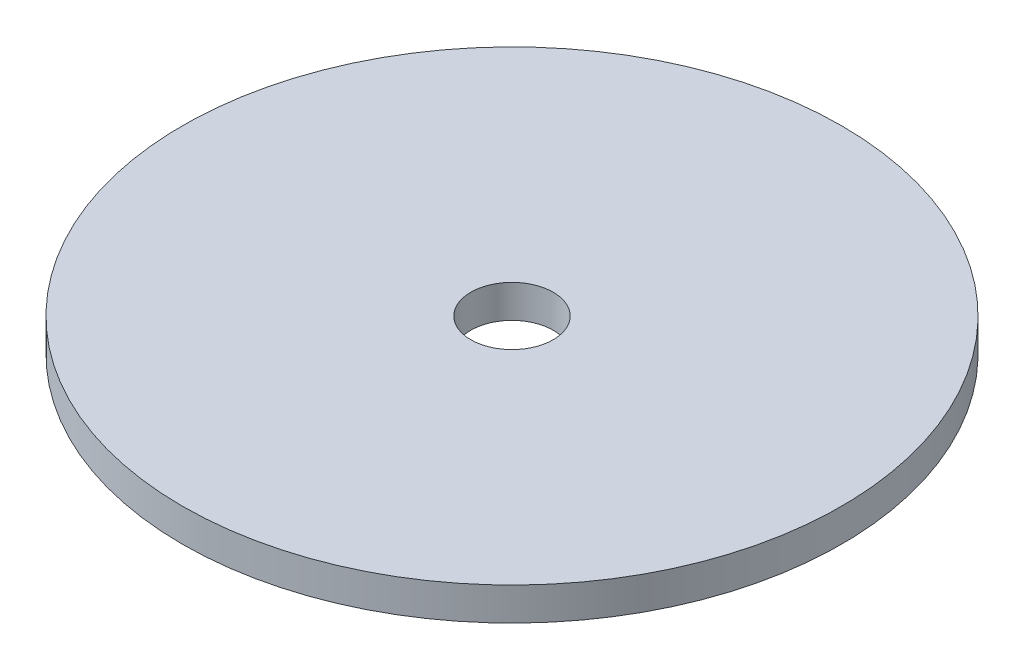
ISO-10303-21;
HEADER;
FILE_DESCRIPTION(('STEP AP214'),'2;1');
FILE_NAME('part.step','',(''),(''),'','','');
FILE_SCHEMA(('AUTOMOTIVE_DESIGN { 1 0 10303 214 1 1 1 1 }'));
ENDSEC;
DATA;
#1=APPLICATION_CONTEXT('core data for automotive mechanical design processes');
#2=APPLICATION_PROTOCOL_DEFINITION('international standard','automotive_design',2000,#1);
#3=PRODUCT_CONTEXT('',#1,'mechanical');
#4=PRODUCT('Part','Part','',(#3));
#5=PRODUCT_RELATED_PRODUCT_CATEGORY('part','',(#4));
#6=PRODUCT_DEFINITION_FORMATION('','',#4);
#7=PRODUCT_DEFINITION_CONTEXT('part definition',#1,'design');
#8=PRODUCT_DEFINITION('design','',#6,#7);
#9=PRODUCT_DEFINITION_SHAPE('','',#8);
#10=(LENGTH_UNIT() NAMED_UNIT(*) SI_UNIT(.MILLI.,.METRE.));
#11=(NAMED_UNIT(*) PLANE_ANGLE_UNIT() SI_UNIT($,.RADIAN.));
#12=(NAMED_UNIT(*) SI_UNIT($,.STERADIAN.) SOLID_ANGLE_UNIT());
#13=UNCERTAINTY_MEASURE_WITH_UNIT(LENGTH_MEASURE(1.E-05),#10,'distance_accuracy_value','');
#14=(GEOMETRIC_REPRESENTATION_CONTEXT(3) GLOBAL_UNCERTAINTY_ASSIGNED_CONTEXT((#13)) GLOBAL_UNIT_ASSIGNED_CONTEXT((#10,
#11,#12)) REPRESENTATION_CONTEXT('',''));
#15=CARTESIAN_POINT('',(0.,0.,0.));
#16=DIRECTION('',(0.,0.,1.));
#17=DIRECTION('',(1.,0.,0.));
#18=AXIS2_PLACEMENT_3D('',#15,#16,#17);
#19=CARTESIAN_POINT('',(0.,2.,0.));
#20=DIRECTION('',(0.,1.,0.));
#21=DIRECTION('',(0.,0.,1.));
#22=AXIS2_PLACEMENT_3D('',#19,#20,#21);
#23=PLANE('',#22);
#24=CARTESIAN_POINT('',(0.,2.,0.));
#25=DIRECTION('',(0.,1.,0.));
#26=DIRECTION('',(0.,0.,1.));
#27=AXIS2_PLACEMENT_3D('',#24,#25,#26);
#28=CIRCLE('',#27,20.);
#29=CARTESIAN_POINT('',(0.,2.,20.));
#30=VERTEX_POINT('',#29);
#31=EDGE_CURVE('E10',#30,#30,#28,.T.);
#32=ORIENTED_EDGE('',*,*,#31,.T.);
#33=EDGE_LOOP('',(#32));
#34=FACE_BOUND('',#33,.T.);
#35=CARTESIAN_POINT('',(0.,2.,0.));
#36=DIRECTION('',(0.,1.,0.));
#37=DIRECTION('',(0.,0.,1.));
#38=AXIS2_PLACEMENT_3D('',#35,#36,#37);
#39=CIRCLE('',#38,2.5);
#40=CARTESIAN_POINT('',(0.,2.,2.5));
#41=VERTEX_POINT('',#40);
#42=EDGE_CURVE('E42',#41,#41,#39,.T.);
#43=ORIENTED_EDGE('',*,*,#42,.F.);
#44=EDGE_LOOP('',(#43));
#45=FACE_BOUND('',#44,.T.);
#46=ADVANCED_FACE('F31',(#34,#45),#23,.T.);
#47=CARTESIAN_POINT('',(0.,0.,0.));
#48=DIRECTION('',(0.,1.,0.));
#49=DIRECTION('',(0.,0.,1.));
#50=AXIS2_PLACEMENT_3D('',#47,#48,#49);
#51=PLANE('',#50);
#52=CARTESIAN_POINT('',(0.,0.,0.));
#53=DIRECTION('',(0.,1.,0.));
#54=DIRECTION('',(0.,0.,1.));
#55=AXIS2_PLACEMENT_3D('',#52,#53,#54);
#56=CIRCLE('',#55,20.);
#57=CARTESIAN_POINT('',(0.,0.,20.));
#58=VERTEX_POINT('',#57);
#59=EDGE_CURVE('E35',#58,#58,#56,.T.);
#60=ORIENTED_EDGE('',*,*,#59,.F.);
#61=EDGE_LOOP('',(#60));
#62=FACE_BOUND('',#61,.T.);
#63=CARTESIAN_POINT('',(0.,0.,0.));
#64=DIRECTION('',(0.,1.,0.));
#65=DIRECTION('',(0.,0.,1.));
#66=AXIS2_PLACEMENT_3D('',#63,#64,#65);
#67=CIRCLE('',#66,2.5);
#68=CARTESIAN_POINT('',(0.,0.,2.5));
#69=VERTEX_POINT('',#68);
#70=EDGE_CURVE('E44',#69,#69,#67,.T.);
#71=ORIENTED_EDGE('',*,*,#70,.T.);
#72=EDGE_LOOP('',(#71));
#73=FACE_BOUND('',#72,.T.);
#74=ADVANCED_FACE('F54',(#62,#73),#51,.F.);
#75=CARTESIAN_POINT('',(0.,2.,0.));
#76=DIRECTION('',(0.,-1.,0.));
#77=DIRECTION('',(0.,0.,-1.));
#78=AXIS2_PLACEMENT_3D('',#75,#76,#77);
#79=CYLINDRICAL_SURFACE('',#78,20.);
#80=ORIENTED_EDGE('',*,*,#31,.F.);
#81=EDGE_LOOP('',(#80));
#82=FACE_BOUND('',#81,.T.);
#83=ORIENTED_EDGE('',*,*,#59,.T.);
#84=EDGE_LOOP('',(#83));
#85=FACE_BOUND('',#84,.T.);
#86=ADVANCED_FACE('F33',(#82,#85),#79,.T.);
#87=CARTESIAN_POINT('',(0.,2.,0.));
#88=DIRECTION('',(0.,-1.,0.));
#89=DIRECTION('',(0.,0.,-1.));
#90=AXIS2_PLACEMENT_3D('',#87,#88,#89);
#91=CYLINDRICAL_SURFACE('',#90,2.5);
#92=ORIENTED_EDGE('',*,*,#42,.T.);
#93=EDGE_LOOP('',(#92));
#94=FACE_BOUND('',#93,.T.);
#95=ORIENTED_EDGE('',*,*,#70,.F.);
#96=EDGE_LOOP('',(#95));
#97=FACE_BOUND('',#96,.T.);
#98=ADVANCED_FACE('F50',(#94,#97),#91,.F.);
#99=CLOSED_SHELL('',(#46,#74,#86,#98));
#100=MANIFOLD_SOLID_BREP('B2',#99);
#101=ADVANCED_BREP_SHAPE_REPRESENTATION('',(#18,#100),#14);
#102=SHAPE_DEFINITION_REPRESENTATION(#9,#101);
ENDSEC;
END-ISO-10303-21;
